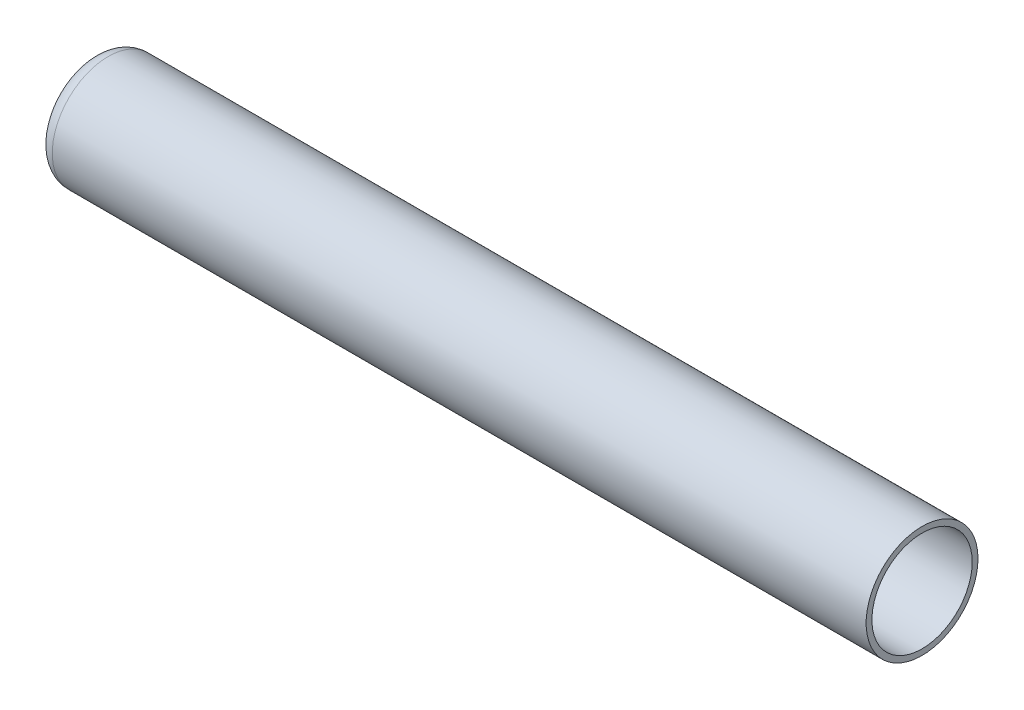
from build123d import *


with BuildPart() as part:
    # Esquisse1 → R_volution1 (revolve)
    with BuildSketch(Plane.XY, mode=Mode.PRIVATE) as r_volution1_sk:
        with BuildLine():
            Line((0, 10.5), (0, 0))
            Line((0, 0), (1.5, 0))
            Line((1.5, 0), (1.5, 10.5))
            ThreePointArc((1.5, 10.5), (2.232233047, 12.267766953), (4, 13))
            Line((4, 13), (215, 13))
            Line((215, 13), (215, 14.5))
            Line((215, 14.5), (4, 14.5))
            ThreePointArc((4, 14.5), (1.171572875, 13.328427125), (0, 10.5))
        make_face()
    revolve(r_volution1_sk.sketch.rotate(Axis((-0.001250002, 0, 0), (1, 0, 0)), 270), axis=Axis((-0.001250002, 0, 0), (1, 0, 0)))


solid = part.part
